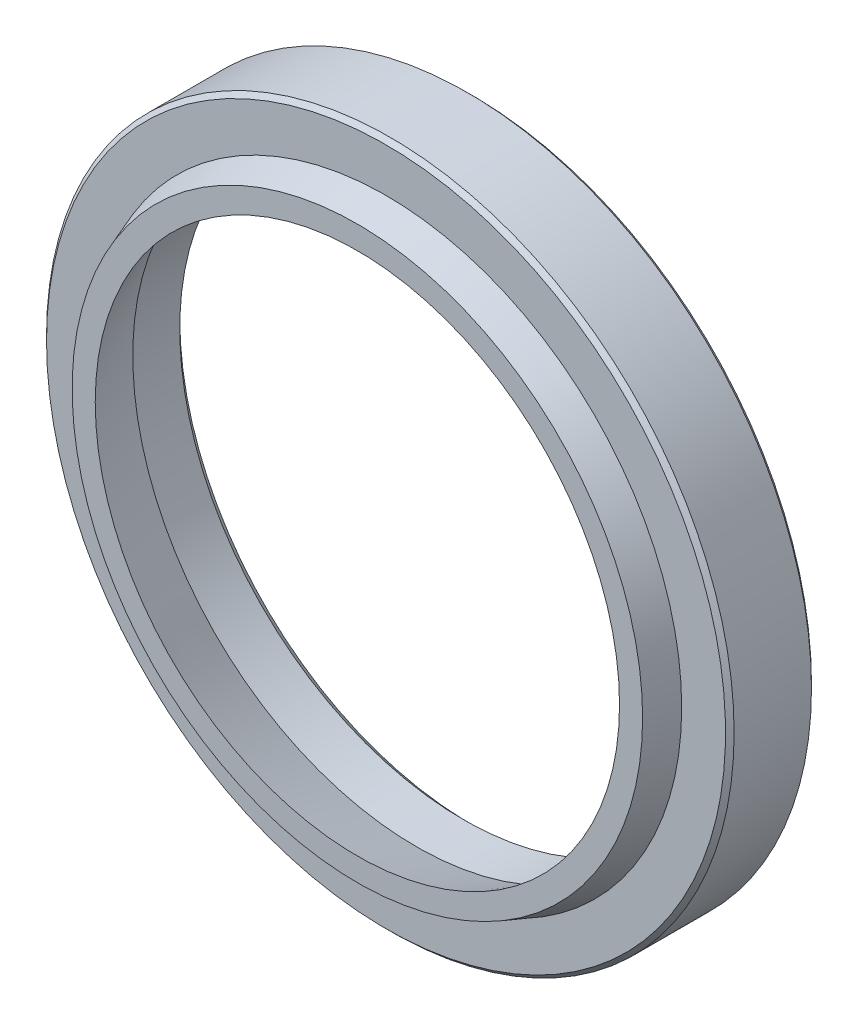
from build123d import *

# Parameters (mm, degrees)
ENDCHAMFER_SIZE  = 0.5
BODYCHAMFER_SIZE = 0.25


with BuildPart() as part:
    # Sketch1 → Body (revolve)
    with BuildSketch(Plane(origin=(0, 0, 0), x_dir=(-1, 0, 0), z_dir=(0, 1, 0)), mode=Mode.PRIVATE) as body_sk:
        Polygon((16.5, -6.666666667), (16.5, -3.434346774), (15.25, 0), (16.593382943, 0), (17.2, -1.666666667), (20, -1.666666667), (20, -6.666666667), align=None)
    revolve(body_sk.sketch.rotate(Axis((0, 0, 9.195898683), (0, 0, -1)), 180), axis=Axis((0, 0, 9.195898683), (0, 0, -1)))

    # EndChamfer
    endchamfer_edges = [part.edges().sort_by_distance(p)[0] for p in [
        (-16.5, 0, -6.666666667),
    ]]
    chamfer(endchamfer_edges, length=ENDCHAMFER_SIZE)

    # BodyChamfer
    bodychamfer_edges = [part.edges().sort_by_distance(p)[0] for p in [
        (-20, 0, -1.666666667),
        (-20, 0, -6.666666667),
    ]]
    chamfer(bodychamfer_edges, length=BODYCHAMFER_SIZE)


solid = part.part
